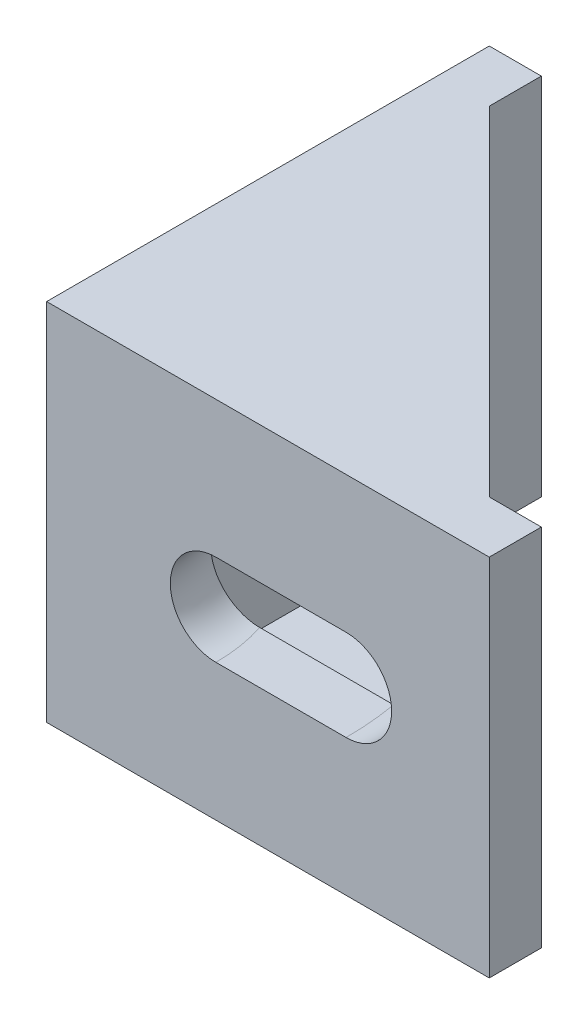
ISO-10303-21;
HEADER;
FILE_DESCRIPTION(('STEP AP214'),'2;1');
FILE_NAME('part.step','',(''),(''),'','','');
FILE_SCHEMA(('AUTOMOTIVE_DESIGN { 1 0 10303 214 1 1 1 1 }'));
ENDSEC;
DATA;
#1=APPLICATION_CONTEXT('core data for automotive mechanical design processes');
#2=APPLICATION_PROTOCOL_DEFINITION('international standard','automotive_design',2000,#1);
#3=PRODUCT_CONTEXT('',#1,'mechanical');
#4=PRODUCT('Part','Part','',(#3));
#5=PRODUCT_RELATED_PRODUCT_CATEGORY('part','',(#4));
#6=PRODUCT_DEFINITION_FORMATION('','',#4);
#7=PRODUCT_DEFINITION_CONTEXT('part definition',#1,'design');
#8=PRODUCT_DEFINITION('design','',#6,#7);
#9=PRODUCT_DEFINITION_SHAPE('','',#8);
#10=(LENGTH_UNIT() NAMED_UNIT(*) SI_UNIT(.MILLI.,.METRE.));
#11=(NAMED_UNIT(*) PLANE_ANGLE_UNIT() SI_UNIT($,.RADIAN.));
#12=(NAMED_UNIT(*) SI_UNIT($,.STERADIAN.) SOLID_ANGLE_UNIT());
#13=UNCERTAINTY_MEASURE_WITH_UNIT(LENGTH_MEASURE(1.E-05),#10,'distance_accuracy_value','');
#14=(GEOMETRIC_REPRESENTATION_CONTEXT(3) GLOBAL_UNCERTAINTY_ASSIGNED_CONTEXT((#13)) GLOBAL_UNIT_ASSIGNED_CONTEXT((#10,
#11,#12)) REPRESENTATION_CONTEXT('',''));
#15=CARTESIAN_POINT('',(0.,0.,0.));
#16=DIRECTION('',(0.,0.,1.));
#17=DIRECTION('',(1.,0.,0.));
#18=AXIS2_PLACEMENT_3D('',#15,#16,#17);
#19=CARTESIAN_POINT('',(34.,28.,-25.8974864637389));
#20=DIRECTION('',(-0.707106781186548,0.,0.707106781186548));
#21=DIRECTION('',(0.707106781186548,0.,0.707106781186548));
#22=AXIS2_PLACEMENT_3D('',#19,#20,#21);
#23=PLANE('',#22);
#24=DIRECTION('',(-0.707106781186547,0.,-0.707106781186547));
#25=VECTOR('',#24,1.);
#26=CARTESIAN_POINT('',(34.,28.,-25.8974864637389));
#27=LINE('',#26,#25);
#28=CARTESIAN_POINT('',(30.,28.,-29.8974864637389));
#29=VERTEX_POINT('',#28);
#30=CARTESIAN_POINT('',(4.00000000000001,28.,-55.8974864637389));
#31=VERTEX_POINT('',#30);
#32=EDGE_CURVE('E56',#29,#31,#27,.T.);
#33=ORIENTED_EDGE('',*,*,#32,.F.);
#34=DIRECTION('',(0.,-1.,0.));
#35=VECTOR('',#34,1.);
#36=CARTESIAN_POINT('',(30.,33.6568542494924,-29.8974864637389));
#37=LINE('',#36,#35);
#38=CARTESIAN_POINT('',(30.,26.,-29.8974864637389));
#39=VERTEX_POINT('',#38);
#40=EDGE_CURVE('E189',#29,#39,#37,.T.);
#41=ORIENTED_EDGE('',*,*,#40,.T.);
#42=DIRECTION('',(-0.707106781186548,0.,-0.707106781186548));
#43=VECTOR('',#42,1.);
#44=CARTESIAN_POINT('',(34.,26.,-25.8974864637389));
#45=LINE('',#44,#43);
#46=CARTESIAN_POINT('',(4.,26.,-55.8974864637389));
#47=VERTEX_POINT('',#46);
#48=EDGE_CURVE('E300',#39,#47,#45,.T.);
#49=ORIENTED_EDGE('',*,*,#48,.T.);
#50=DIRECTION('',(0.,-1.,0.));
#51=VECTOR('',#50,1.);
#52=CARTESIAN_POINT('',(4.00000000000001,33.6568542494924,-55.8974864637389));
#53=LINE('',#52,#51);
#54=EDGE_CURVE('E49',#31,#47,#53,.T.);
#55=ORIENTED_EDGE('',*,*,#54,.F.);
#56=EDGE_LOOP('',(#33,#41,#49,#55));
#57=FACE_BOUND('',#56,.T.);
#58=ADVANCED_FACE('F35',(#57),#23,.F.);
#59=DIRECTION('',(0.707106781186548,0.,0.707106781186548));
#60=VECTOR('',#59,1.);
#61=CARTESIAN_POINT('',(34.,2.,-25.8974864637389));
#62=LINE('',#61,#60);
#63=CARTESIAN_POINT('',(4.,1.99999999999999,-55.8974864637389));
#64=VERTEX_POINT('',#63);
#65=CARTESIAN_POINT('',(30.,2.,-29.8974864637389));
#66=VERTEX_POINT('',#65);
#67=EDGE_CURVE('E296',#64,#66,#62,.T.);
#68=ORIENTED_EDGE('',*,*,#67,.T.);
#69=CARTESIAN_POINT('',(30.,0.,-29.8974864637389));
#70=VERTEX_POINT('',#69);
#71=EDGE_CURVE('E64',#66,#70,#37,.T.);
#72=ORIENTED_EDGE('',*,*,#71,.T.);
#73=DIRECTION('',(-0.707106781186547,0.,-0.707106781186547));
#74=VECTOR('',#73,1.);
#75=CARTESIAN_POINT('',(34.,0.,-25.8974864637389));
#76=LINE('',#75,#74);
#77=CARTESIAN_POINT('',(4.00000000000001,0.,-55.8974864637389));
#78=VERTEX_POINT('',#77);
#79=EDGE_CURVE('E306',#70,#78,#76,.T.);
#80=ORIENTED_EDGE('',*,*,#79,.T.);
#81=EDGE_CURVE('E11',#64,#78,#53,.T.);
#82=ORIENTED_EDGE('',*,*,#81,.F.);
#83=EDGE_LOOP('',(#68,#72,#80,#82));
#84=FACE_BOUND('',#83,.T.);
#85=ADVANCED_FACE('F37',(#84),#23,.F.);
#86=CARTESIAN_POINT('',(0.,28.,-59.8974864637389));
#87=DIRECTION('',(1.,0.,0.));
#88=DIRECTION('',(0.,0.,-1.));
#89=AXIS2_PLACEMENT_3D('',#86,#87,#88);
#90=PLANE('',#89);
#91=DIRECTION('',(0.,0.,1.));
#92=VECTOR('',#91,1.);
#93=CARTESIAN_POINT('',(0.,17.5,-59.8974864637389));
#94=LINE('',#93,#92);
#95=CARTESIAN_POINT('',(0.,17.5,-48.8974864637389));
#96=VERTEX_POINT('',#95);
#97=CARTESIAN_POINT('',(0.,17.5,-38.8974864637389));
#98=VERTEX_POINT('',#97);
#99=EDGE_CURVE('E347',#96,#98,#94,.T.);
#100=ORIENTED_EDGE('',*,*,#99,.T.);
#101=CARTESIAN_POINT('',(0.,14.,-38.8974864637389));
#102=DIRECTION('',(1.,0.,0.));
#103=DIRECTION('',(0.,0.,-1.));
#104=AXIS2_PLACEMENT_3D('',#101,#102,#103);
#105=CIRCLE('',#104,3.5);
#106=CARTESIAN_POINT('',(0.,10.5,-38.8974864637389));
#107=VERTEX_POINT('',#106);
#108=EDGE_CURVE('E345',#98,#107,#105,.T.);
#109=ORIENTED_EDGE('',*,*,#108,.T.);
#110=DIRECTION('',(0.,0.,-1.));
#111=VECTOR('',#110,1.);
#112=CARTESIAN_POINT('',(0.,10.5,-59.8974864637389));
#113=LINE('',#112,#111);
#114=CARTESIAN_POINT('',(0.,10.5,-48.8974864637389));
#115=VERTEX_POINT('',#114);
#116=EDGE_CURVE('E232',#107,#115,#113,.T.);
#117=ORIENTED_EDGE('',*,*,#116,.T.);
#118=CARTESIAN_POINT('',(0.,14.,-48.8974864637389));
#119=DIRECTION('',(1.,0.,0.));
#120=DIRECTION('',(0.,0.,-1.));
#121=AXIS2_PLACEMENT_3D('',#118,#119,#120);
#122=CIRCLE('',#121,3.5);
#123=EDGE_CURVE('E337',#115,#96,#122,.T.);
#124=ORIENTED_EDGE('',*,*,#123,.T.);
#125=EDGE_LOOP('',(#100,#109,#117,#124));
#126=FACE_BOUND('',#125,.T.);
#127=DIRECTION('',(0.,0.,1.));
#128=VECTOR('',#127,1.);
#129=CARTESIAN_POINT('',(0.,0.,-59.8974864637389));
#130=LINE('',#129,#128);
#131=CARTESIAN_POINT('',(0.,0.,-59.8974864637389));
#132=VERTEX_POINT('',#131);
#133=CARTESIAN_POINT('',(0.,0.,-25.8974864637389));
#134=VERTEX_POINT('',#133);
#135=EDGE_CURVE('E308',#132,#134,#130,.T.);
#136=ORIENTED_EDGE('',*,*,#135,.T.);
#137=DIRECTION('',(0.,-1.,0.));
#138=VECTOR('',#137,1.);
#139=CARTESIAN_POINT('',(0.,28.,-25.8974864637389));
#140=LINE('',#139,#138);
#141=CARTESIAN_POINT('',(0.,28.,-25.8974864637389));
#142=VERTEX_POINT('',#141);
#143=EDGE_CURVE('E320',#142,#134,#140,.T.);
#144=ORIENTED_EDGE('',*,*,#143,.F.);
#145=DIRECTION('',(0.,0.,1.));
#146=VECTOR('',#145,1.);
#147=CARTESIAN_POINT('',(0.,28.,-59.8974864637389));
#148=LINE('',#147,#146);
#149=CARTESIAN_POINT('',(0.,28.,-59.8974864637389));
#150=VERTEX_POINT('',#149);
#151=EDGE_CURVE('E372',#150,#142,#148,.T.);
#152=ORIENTED_EDGE('',*,*,#151,.F.);
#153=DIRECTION('',(0.,-1.,0.));
#154=VECTOR('',#153,1.);
#155=CARTESIAN_POINT('',(0.,28.,-59.8974864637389));
#156=LINE('',#155,#154);
#157=EDGE_CURVE('E301',#150,#132,#156,.T.);
#158=ORIENTED_EDGE('',*,*,#157,.T.);
#159=EDGE_LOOP('',(#136,#144,#152,#158));
#160=FACE_BOUND('',#159,.T.);
#161=ADVANCED_FACE('F289',(#126,#160),#90,.F.);
#162=CARTESIAN_POINT('',(0.,28.,-25.8974864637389));
#163=DIRECTION('',(0.,0.,-1.));
#164=DIRECTION('',(-1.,0.,0.));
#165=AXIS2_PLACEMENT_3D('',#162,#163,#164);
#166=PLANE('',#165);
#167=DIRECTION('',(-1.,0.,0.));
#168=VECTOR('',#167,1.);
#169=CARTESIAN_POINT('',(0.,10.5,-25.8974864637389));
#170=LINE('',#169,#168);
#171=CARTESIAN_POINT('',(23.,10.5,-25.8974864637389));
#172=VERTEX_POINT('',#171);
#173=CARTESIAN_POINT('',(13.,10.5,-25.8974864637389));
#174=VERTEX_POINT('',#173);
#175=EDGE_CURVE('E229',#172,#174,#170,.T.);
#176=ORIENTED_EDGE('',*,*,#175,.T.);
#177=CARTESIAN_POINT('',(13.,14.,-25.8974864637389));
#178=DIRECTION('',(0.,0.,-1.));
#179=DIRECTION('',(-1.,0.,0.));
#180=AXIS2_PLACEMENT_3D('',#177,#178,#179);
#181=CIRCLE('',#180,3.5);
#182=CARTESIAN_POINT('',(13.,17.5,-25.8974864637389));
#183=VERTEX_POINT('',#182);
#184=EDGE_CURVE('E353',#174,#183,#181,.T.);
#185=ORIENTED_EDGE('',*,*,#184,.T.);
#186=DIRECTION('',(1.,0.,0.));
#187=VECTOR('',#186,1.);
#188=CARTESIAN_POINT('',(0.,17.5,-25.8974864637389));
#189=LINE('',#188,#187);
#190=CARTESIAN_POINT('',(23.,17.5,-25.8974864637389));
#191=VERTEX_POINT('',#190);
#192=EDGE_CURVE('E350',#183,#191,#189,.T.);
#193=ORIENTED_EDGE('',*,*,#192,.T.);
#194=CARTESIAN_POINT('',(23.,14.,-25.8974864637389));
#195=DIRECTION('',(0.,0.,-1.));
#196=DIRECTION('',(-1.,0.,0.));
#197=AXIS2_PLACEMENT_3D('',#194,#195,#196);
#198=CIRCLE('',#197,3.5);
#199=EDGE_CURVE('E242',#191,#172,#198,.T.);
#200=ORIENTED_EDGE('',*,*,#199,.T.);
#201=EDGE_LOOP('',(#176,#185,#193,#200));
#202=FACE_BOUND('',#201,.T.);
#203=DIRECTION('',(1.,0.,0.));
#204=VECTOR('',#203,1.);
#205=CARTESIAN_POINT('',(0.,0.,-25.8974864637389));
#206=LINE('',#205,#204);
#207=CARTESIAN_POINT('',(34.,0.,-25.8974864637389));
#208=VERTEX_POINT('',#207);
#209=EDGE_CURVE('E311',#134,#208,#206,.T.);
#210=ORIENTED_EDGE('',*,*,#209,.T.);
#211=DIRECTION('',(0.,-1.,0.));
#212=VECTOR('',#211,1.);
#213=CARTESIAN_POINT('',(34.,28.,-25.8974864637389));
#214=LINE('',#213,#212);
#215=CARTESIAN_POINT('',(34.,28.,-25.8974864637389));
#216=VERTEX_POINT('',#215);
#217=EDGE_CURVE('E318',#216,#208,#214,.T.);
#218=ORIENTED_EDGE('',*,*,#217,.F.);
#219=DIRECTION('',(1.,0.,0.));
#220=VECTOR('',#219,1.);
#221=CARTESIAN_POINT('',(0.,28.,-25.8974864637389));
#222=LINE('',#221,#220);
#223=EDGE_CURVE('E174',#142,#216,#222,.T.);
#224=ORIENTED_EDGE('',*,*,#223,.F.);
#225=ORIENTED_EDGE('',*,*,#143,.T.);
#226=EDGE_LOOP('',(#210,#218,#224,#225));
#227=FACE_BOUND('',#226,.T.);
#228=ADVANCED_FACE('F293',(#202,#227),#166,.F.);
#229=CARTESIAN_POINT('',(0.,28.,0.));
#230=DIRECTION('',(0.,1.,0.));
#231=DIRECTION('',(0.,0.,1.));
#232=AXIS2_PLACEMENT_3D('',#229,#230,#231);
#233=PLANE('',#232);
#234=ORIENTED_EDGE('',*,*,#223,.T.);
#235=DIRECTION('',(0.,0.,1.));
#236=VECTOR('',#235,1.);
#237=CARTESIAN_POINT('',(34.,28.,-25.8974864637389));
#238=LINE('',#237,#236);
#239=CARTESIAN_POINT('',(34.,28.,-29.8974864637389));
#240=VERTEX_POINT('',#239);
#241=EDGE_CURVE('E167',#240,#216,#238,.T.);
#242=ORIENTED_EDGE('',*,*,#241,.F.);
#243=DIRECTION('',(1.,0.,0.));
#244=VECTOR('',#243,1.);
#245=CARTESIAN_POINT('',(34.,28.,-29.8974864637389));
#246=LINE('',#245,#244);
#247=EDGE_CURVE('E171',#29,#240,#246,.T.);
#248=ORIENTED_EDGE('',*,*,#247,.F.);
#249=ORIENTED_EDGE('',*,*,#32,.T.);
#250=DIRECTION('',(0.,0.,1.));
#251=VECTOR('',#250,1.);
#252=CARTESIAN_POINT('',(4.,28.,-59.8974864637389));
#253=LINE('',#252,#251);
#254=CARTESIAN_POINT('',(4.,28.,-59.8974864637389));
#255=VERTEX_POINT('',#254);
#256=EDGE_CURVE('E206',#255,#31,#253,.T.);
#257=ORIENTED_EDGE('',*,*,#256,.F.);
#258=DIRECTION('',(1.,0.,0.));
#259=VECTOR('',#258,1.);
#260=CARTESIAN_POINT('',(0.,28.,-59.8974864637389));
#261=LINE('',#260,#259);
#262=EDGE_CURVE('E200',#150,#255,#261,.T.);
#263=ORIENTED_EDGE('',*,*,#262,.F.);
#264=ORIENTED_EDGE('',*,*,#151,.T.);
#265=EDGE_LOOP('',(#234,#242,#248,#249,#257,#263,#264));
#266=FACE_BOUND('',#265,.T.);
#267=ADVANCED_FACE('F169',(#266),#233,.T.);
#268=CARTESIAN_POINT('',(0.,0.,0.));
#269=DIRECTION('',(0.,1.,0.));
#270=DIRECTION('',(0.,0.,1.));
#271=AXIS2_PLACEMENT_3D('',#268,#269,#270);
#272=PLANE('',#271);
#273=ORIENTED_EDGE('',*,*,#79,.F.);
#274=DIRECTION('',(1.,0.,0.));
#275=VECTOR('',#274,1.);
#276=CARTESIAN_POINT('',(34.,0.,-29.8974864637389));
#277=LINE('',#276,#275);
#278=CARTESIAN_POINT('',(34.,0.,-29.8974864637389));
#279=VERTEX_POINT('',#278);
#280=EDGE_CURVE('E191',#70,#279,#277,.T.);
#281=ORIENTED_EDGE('',*,*,#280,.T.);
#282=DIRECTION('',(0.,0.,1.));
#283=VECTOR('',#282,1.);
#284=CARTESIAN_POINT('',(34.,0.,-25.8974864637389));
#285=LINE('',#284,#283);
#286=EDGE_CURVE('E183',#279,#208,#285,.T.);
#287=ORIENTED_EDGE('',*,*,#286,.T.);
#288=ORIENTED_EDGE('',*,*,#209,.F.);
#289=ORIENTED_EDGE('',*,*,#135,.F.);
#290=DIRECTION('',(1.,0.,0.));
#291=VECTOR('',#290,1.);
#292=CARTESIAN_POINT('',(0.,0.,-59.8974864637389));
#293=LINE('',#292,#291);
#294=CARTESIAN_POINT('',(4.,0.,-59.8974864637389));
#295=VERTEX_POINT('',#294);
#296=EDGE_CURVE('E196',#132,#295,#293,.T.);
#297=ORIENTED_EDGE('',*,*,#296,.T.);
#298=DIRECTION('',(0.,0.,1.));
#299=VECTOR('',#298,1.);
#300=CARTESIAN_POINT('',(4.,0.,-59.8974864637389));
#301=LINE('',#300,#299);
#302=EDGE_CURVE('E197',#295,#78,#301,.T.);
#303=ORIENTED_EDGE('',*,*,#302,.T.);
#304=EDGE_LOOP('',(#273,#281,#287,#288,#289,#297,#303));
#305=FACE_BOUND('',#304,.T.);
#306=ADVANCED_FACE('F276',(#305),#272,.F.);
#307=CARTESIAN_POINT('',(32.,26.,-59.8974864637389));
#308=DIRECTION('',(0.,1.,0.));
#309=DIRECTION('',(0.,0.,1.));
#310=AXIS2_PLACEMENT_3D('',#307,#308,#309);
#311=PLANE('',#310);
#312=DIRECTION('',(-1.,0.,0.));
#313=VECTOR('',#312,1.);
#314=CARTESIAN_POINT('',(32.,26.,-29.8974864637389));
#315=LINE('',#314,#313);
#316=CARTESIAN_POINT('',(4.,26.,-29.8974864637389));
#317=VERTEX_POINT('',#316);
#318=EDGE_CURVE('E309',#39,#317,#315,.T.);
#319=ORIENTED_EDGE('',*,*,#318,.T.);
#320=DIRECTION('',(0.,0.,-1.));
#321=VECTOR('',#320,1.);
#322=CARTESIAN_POINT('',(4.,26.,-59.8974864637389));
#323=LINE('',#322,#321);
#324=EDGE_CURVE('E369',#317,#47,#323,.T.);
#325=ORIENTED_EDGE('',*,*,#324,.T.);
#326=ORIENTED_EDGE('',*,*,#48,.F.);
#327=EDGE_LOOP('',(#319,#325,#326));
#328=FACE_BOUND('',#327,.T.);
#329=ADVANCED_FACE('F273',(#328),#311,.F.);
#330=CARTESIAN_POINT('',(32.,26.,-29.8974864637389));
#331=DIRECTION('',(0.,0.,1.));
#332=DIRECTION('',(0.,-1.,0.));
#333=AXIS2_PLACEMENT_3D('',#330,#331,#332);
#334=PLANE('',#333);
#335=DIRECTION('',(-1.,0.,0.));
#336=VECTOR('',#335,1.);
#337=CARTESIAN_POINT('',(32.,17.5,-29.8974864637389));
#338=LINE('',#337,#336);
#339=CARTESIAN_POINT('',(22.6495033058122,17.5,-29.8974864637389));
#340=VERTEX_POINT('',#339);
#341=CARTESIAN_POINT('',(12.369316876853,17.5,-29.8974864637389));
#342=VERTEX_POINT('',#341);
#343=EDGE_CURVE('E356',#340,#342,#338,.T.);
#344=ORIENTED_EDGE('',*,*,#343,.T.);
#345=CARTESIAN_POINT('',(8.82464637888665,12.86576886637,-29.8974864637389));
#346=CARTESIAN_POINT('',(8.85966284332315,12.772667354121,-29.8974864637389));
#347=CARTESIAN_POINT('',(8.89887566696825,12.6811357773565,-29.8974864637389));
#348=CARTESIAN_POINT('',(8.9852018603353,12.5018628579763,-29.8974864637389));
#349=CARTESIAN_POINT('',(9.03231898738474,12.4141233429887,-29.8974864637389));
#350=CARTESIAN_POINT('',(9.18493240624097,12.157194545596,-29.8974864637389));
#351=CARTESIAN_POINT('',(9.30161569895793,11.9944916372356,-29.8974864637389));
#352=CARTESIAN_POINT('',(9.55946729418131,11.6912186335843,-29.8974864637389));
#353=CARTESIAN_POINT('',(9.70053496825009,11.5505619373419,-29.8974864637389));
#354=CARTESIAN_POINT('',(10.0029783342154,11.2932712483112,-29.8974864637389));
#355=CARTESIAN_POINT('',(10.1643474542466,11.1766295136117,-29.8974864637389));
#356=CARTESIAN_POINT('',(10.5134805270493,10.9631461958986,-29.8974864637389));
#357=CARTESIAN_POINT('',(10.7022566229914,10.867959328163,-29.8974864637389));
#358=CARTESIAN_POINT('',(11.0926816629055,10.7091330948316,-29.8974864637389));
#359=CARTESIAN_POINT('',(11.2943347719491,10.6455039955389,-29.8974864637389));
#360=CARTESIAN_POINT('',(11.7138624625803,10.5494771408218,-29.8974864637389));
#361=CARTESIAN_POINT('',(11.9320627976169,10.5184941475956,-29.8974864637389));
#362=CARTESIAN_POINT('',(12.3705875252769,10.4937876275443,-29.8974864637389));
#363=CARTESIAN_POINT('',(12.5909119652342,10.5000649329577,-29.8974864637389));
#364=CARTESIAN_POINT('',(13.0260837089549,10.5501690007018,-29.8974864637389));
#365=CARTESIAN_POINT('',(13.2409541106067,10.5937934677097,-29.8974864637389));
#366=CARTESIAN_POINT('',(13.6598446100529,10.7177738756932,-29.8974864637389));
#367=CARTESIAN_POINT('',(13.8638665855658,10.7981234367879,-29.8974864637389));
#368=CARTESIAN_POINT('',(14.2477744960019,10.990487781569,-29.8974864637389));
#369=CARTESIAN_POINT('',(14.4282442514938,11.1013365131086,-29.8974864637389));
#370=CARTESIAN_POINT('',(14.766965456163,11.3529648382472,-29.8974864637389));
#371=CARTESIAN_POINT('',(14.9252220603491,11.4937374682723,-29.8974864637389));
#372=CARTESIAN_POINT('',(15.2082062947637,11.7950288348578,-29.8974864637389));
#373=CARTESIAN_POINT('',(15.3340334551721,11.9545151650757,-29.8974864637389));
#374=CARTESIAN_POINT('',(15.5560303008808,12.2929468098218,-29.8974864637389));
#375=CARTESIAN_POINT('',(15.6522060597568,12.4718881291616,-29.8974864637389));
#376=CARTESIAN_POINT('',(15.8089361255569,12.8377186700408,-29.8974864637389));
#377=CARTESIAN_POINT('',(15.8705657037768,13.0241477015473,-29.8974864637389));
#378=CARTESIAN_POINT('',(15.9609570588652,13.4048076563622,-29.8974864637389));
#379=CARTESIAN_POINT('',(15.989723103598,13.5990375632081,-29.8974864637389));
#380=CARTESIAN_POINT('',(16.0131951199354,13.9857556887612,-29.8974864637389));
#381=CARTESIAN_POINT('',(16.0085496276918,14.178204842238,-29.8974864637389));
#382=CARTESIAN_POINT('',(15.9668847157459,14.5595573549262,-29.8974864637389));
#383=CARTESIAN_POINT('',(15.9298667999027,14.7484608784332,-29.8974864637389));
#384=CARTESIAN_POINT('',(15.8248449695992,15.1167134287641,-29.8974864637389));
#385=CARTESIAN_POINT('',(15.7569505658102,15.2960937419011,-29.8974864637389));
#386=CARTESIAN_POINT('',(15.5923588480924,15.6410986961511,-29.8974864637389));
#387=CARTESIAN_POINT('',(15.4956605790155,15.8067228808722,-29.8974864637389));
#388=CARTESIAN_POINT('',(15.2750927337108,16.1217709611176,-29.8974864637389));
#389=CARTESIAN_POINT('',(15.1509068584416,16.2709732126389,-29.8974864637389));
#390=CARTESIAN_POINT('',(14.8798275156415,16.5470594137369,-29.8974864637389));
#391=CARTESIAN_POINT('',(14.732931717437,16.6739410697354,-29.8974864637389));
#392=CARTESIAN_POINT('',(14.4165787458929,16.9054279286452,-29.8974864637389));
#393=CARTESIAN_POINT('',(14.2466317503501,17.0093632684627,-29.8974864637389));
#394=CARTESIAN_POINT('',(13.8921786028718,17.1883713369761,-29.8974864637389));
#395=CARTESIAN_POINT('',(13.707670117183,17.2634394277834,-29.8974864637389));
#396=CARTESIAN_POINT('',(13.3221884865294,17.3855326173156,-29.8974864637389));
#397=CARTESIAN_POINT('',(13.120860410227,17.431436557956,-29.8974864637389));
#398=CARTESIAN_POINT('',(12.7134448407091,17.4901799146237,-29.8974864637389));
#399=CARTESIAN_POINT('',(12.5073564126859,17.5030127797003,-29.8974864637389));
#400=CARTESIAN_POINT('',(12.0877075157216,17.4956590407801,-29.8974864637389));
#401=CARTESIAN_POINT('',(11.8741696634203,17.4741629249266,-29.8974864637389));
#402=CARTESIAN_POINT('',(11.4534455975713,17.3966280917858,-29.8974864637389));
#403=CARTESIAN_POINT('',(11.2462606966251,17.3405822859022,-29.8974864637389));
#404=CARTESIAN_POINT('',(10.8383200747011,17.1935156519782,-29.8974864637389));
#405=CARTESIAN_POINT('',(10.6378887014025,17.1015918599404,-29.8974864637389));
#406=CARTESIAN_POINT('',(10.2554194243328,16.8851850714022,-29.8974864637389));
#407=CARTESIAN_POINT('',(10.0733838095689,16.7606980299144,-29.8974864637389));
#408=CARTESIAN_POINT('',(9.73495613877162,16.4830240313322,-29.8974864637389));
#409=CARTESIAN_POINT('',(9.5783628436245,16.330085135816,-29.8974864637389));
#410=CARTESIAN_POINT('',(9.36602514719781,16.0816953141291,-29.8974864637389));
#411=CARTESIAN_POINT('',(9.29897962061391,15.995692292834,-29.8974864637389));
#412=CARTESIAN_POINT('',(9.17310612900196,15.8178895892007,-29.8974864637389));
#413=CARTESIAN_POINT('',(9.11427386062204,15.7260929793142,-29.8974864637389));
#414=CARTESIAN_POINT('',(9.00887783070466,15.5431356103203,-29.8974864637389));
#415=CARTESIAN_POINT('',(8.96178353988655,15.4522798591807,-29.8974864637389));
#416=CARTESIAN_POINT('',(8.87605495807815,15.2667043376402,-29.8974864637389));
#417=CARTESIAN_POINT('',(8.83741650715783,15.1719864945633,-29.8974864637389));
#418=CARTESIAN_POINT('',(8.76908994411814,14.979379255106,-29.8974864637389));
#419=CARTESIAN_POINT('',(8.73940117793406,14.8814900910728,-29.8974864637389));
#420=CARTESIAN_POINT('',(8.68939929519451,14.6833483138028,-29.8974864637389));
#421=CARTESIAN_POINT('',(8.66908519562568,14.5830959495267,-29.8974864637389));
#422=CARTESIAN_POINT('',(8.63948168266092,14.3898772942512,-29.8974864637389));
#423=CARTESIAN_POINT('',(8.62938876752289,14.2970333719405,-29.8974864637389));
#424=CARTESIAN_POINT('',(8.61740897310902,14.1108204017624,-29.8974864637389));
#425=CARTESIAN_POINT('',(8.61552152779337,14.0174513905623,-29.8974864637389));
#426=CARTESIAN_POINT('',(8.61997409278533,13.8310481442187,-29.8974864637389));
#427=CARTESIAN_POINT('',(8.62630205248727,13.7380136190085,-29.8974864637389));
#428=CARTESIAN_POINT('',(8.64707651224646,13.5528899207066,-29.8974864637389));
#429=CARTESIAN_POINT('',(8.66152006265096,13.4608004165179,-29.8974864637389));
#430=CARTESIAN_POINT('',(8.69721455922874,13.2837824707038,-29.8974864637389));
#431=CARTESIAN_POINT('',(8.71799779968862,13.1987592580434,-29.8974864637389));
#432=CARTESIAN_POINT('',(8.76632249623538,13.0306760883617,-29.8974864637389));
#433=CARTESIAN_POINT('',(8.79386287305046,12.947615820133,-29.8974864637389));
#434=CARTESIAN_POINT('',(8.82464637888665,12.86576886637,-29.8974864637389));
#435=B_SPLINE_CURVE_WITH_KNOTS('',3,(#345,#346,#347,#348,#349,#350,#351,#352,#353,#354,#355,
#356,#357,#358,#359,#360,#361,#362,#363,#364,#365,#366,#367,#368,#369,#370,#371,#372,#373,#374,
#375,#376,#377,#378,#379,#380,#381,#382,#383,#384,#385,#386,#387,#388,#389,#390,#391,#392,#393,
#394,#395,#396,#397,#398,#399,#400,#401,#402,#403,#404,#405,#406,#407,#408,#409,#410,#411,#412,
#413,#414,#415,#416,#417,#418,#419,#420,#421,#422,#423,#424,#425,#426,#427,#428,#429,#430,#431,
#432,#433,#434),.UNSPECIFIED.,.T.,.F.,(4,2,2,2,2,2,2,2,2,2,2,2,2,2,2,2,2,2,2,2,2,2,2,2,2,2,2,2,
2,2,2,2,2,2,2,2,2,2,2,2,2,2,2,2,4),(0.,0.298312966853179,0.596768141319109,1.19430138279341,
1.78942518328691,2.3843568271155,3.01580421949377,3.64745689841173,4.30548011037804,
4.96351801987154,5.61801397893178,6.27239628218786,6.90459039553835,7.53663755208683,
8.14305055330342,8.74933925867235,9.33552721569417,9.92163903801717,10.4964052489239,
11.0711447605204,11.6438615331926,12.2165972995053,12.7963020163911,13.3760662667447,
13.9710027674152,14.5660348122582,15.182742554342,15.7995724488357,16.4404992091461,
17.0815575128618,17.7399142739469,18.3983528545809,19.0512990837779,19.3780654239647,
19.7046599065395,20.0112636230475,20.3177161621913,20.6241462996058,20.9305442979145,
21.2103628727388,21.4901621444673,21.76955146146,22.0488392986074,22.3111326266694,
22.5733840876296),.UNSPECIFIED.);
#436=CARTESIAN_POINT('',(12.369316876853,10.5,-29.8974864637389));
#437=VERTEX_POINT('',#436);
#438=EDGE_CURVE('E349',#342,#437,#435,.T.);
#439=ORIENTED_EDGE('',*,*,#438,.T.);
#440=DIRECTION('',(1.,0.,0.));
#441=VECTOR('',#440,1.);
#442=CARTESIAN_POINT('',(32.,10.5,-29.8974864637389));
#443=LINE('',#442,#441);
#444=CARTESIAN_POINT('',(22.6495033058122,10.5,-29.8974864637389));
#445=VERTEX_POINT('',#444);
#446=EDGE_CURVE('E226',#437,#445,#443,.T.);
#447=ORIENTED_EDGE('',*,*,#446,.T.);
#448=CARTESIAN_POINT('',(19.5404139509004,12.2909751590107,-29.8974864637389));
#449=CARTESIAN_POINT('',(19.638976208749,12.1184219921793,-29.8974864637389));
#450=CARTESIAN_POINT('',(19.7524110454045,11.9541777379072,-29.8974864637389));
#451=CARTESIAN_POINT('',(20.0054640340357,11.6470302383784,-29.8974864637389));
#452=CARTESIAN_POINT('',(20.1451196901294,11.5041580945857,-29.8974864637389));
#453=CARTESIAN_POINT('',(20.4461554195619,11.243923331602,-29.8974864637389));
#454=CARTESIAN_POINT('',(20.6075076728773,11.1265285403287,-29.8974864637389));
#455=CARTESIAN_POINT('',(20.9473654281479,10.9201207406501,-29.8974864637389));
#456=CARTESIAN_POINT('',(21.1258665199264,10.8311004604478,-29.8974864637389));
#457=CARTESIAN_POINT('',(21.4974921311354,10.6827145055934,-29.8974864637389));
#458=CARTESIAN_POINT('',(21.6907763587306,10.6237486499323,-29.8974864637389));
#459=CARTESIAN_POINT('',(22.0844757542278,10.5387982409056,-29.8974864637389));
#460=CARTESIAN_POINT('',(22.2848916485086,10.5128170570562,-29.8974864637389));
#461=CARTESIAN_POINT('',(22.6889192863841,10.4945102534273,-29.8974864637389));
#462=CARTESIAN_POINT('',(22.892543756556,10.5024635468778,-29.8974864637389));
#463=CARTESIAN_POINT('',(23.2955531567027,10.5525396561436,-29.8974864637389));
#464=CARTESIAN_POINT('',(23.4949381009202,10.5946623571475,-29.8974864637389));
#465=CARTESIAN_POINT('',(23.8831571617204,10.7118663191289,-29.8974864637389));
#466=CARTESIAN_POINT('',(24.0720199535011,10.7868525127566,-29.8974864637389));
#467=CARTESIAN_POINT('',(24.4342810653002,10.9677977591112,-29.8974864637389));
#468=CARTESIAN_POINT('',(24.6076801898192,11.0737551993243,-29.8974864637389));
#469=CARTESIAN_POINT('',(24.9321086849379,11.3124744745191,-29.8974864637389));
#470=CARTESIAN_POINT('',(25.0833546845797,11.4449418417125,-29.8974864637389));
#471=CARTESIAN_POINT('',(25.3610999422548,11.7336860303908,-29.8974864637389));
#472=CARTESIAN_POINT('',(25.4876009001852,11.8899612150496,-29.8974864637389));
#473=CARTESIAN_POINT('',(25.7105465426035,12.2197199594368,-29.8974864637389));
#474=CARTESIAN_POINT('',(25.8073569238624,12.3929563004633,-29.8974864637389));
#475=CARTESIAN_POINT('',(25.9701629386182,12.7533498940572,-29.8974864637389));
#476=CARTESIAN_POINT('',(26.03616052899,12.9405062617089,-29.8974864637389));
#477=CARTESIAN_POINT('',(26.1347968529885,13.3213117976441,-29.8974864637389));
#478=CARTESIAN_POINT('',(26.1677782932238,13.5148722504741,-29.8974864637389));
#479=CARTESIAN_POINT('',(26.2005910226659,13.9047805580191,-29.8974864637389));
#480=CARTESIAN_POINT('',(26.2004235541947,14.1011283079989,-29.8974864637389));
#481=CARTESIAN_POINT('',(26.1670325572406,14.4899704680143,-29.8974864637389));
#482=CARTESIAN_POINT('',(26.1339787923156,14.6824794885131,-29.8974864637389));
#483=CARTESIAN_POINT('',(26.0360635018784,15.0592260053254,-29.8974864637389));
#484=CARTESIAN_POINT('',(25.971202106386,15.243463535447,-29.8974864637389));
#485=CARTESIAN_POINT('',(25.8114894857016,15.5987544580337,-29.8974864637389));
#486=CARTESIAN_POINT('',(25.7165956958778,15.7697887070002,-29.8974864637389));
#487=CARTESIAN_POINT('',(25.4996451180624,16.0936544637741,-29.8974864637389));
#488=CARTESIAN_POINT('',(25.377587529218,16.2464854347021,-29.8974864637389));
#489=CARTESIAN_POINT('',(25.1088286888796,16.5308848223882,-29.8974864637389));
#490=CARTESIAN_POINT('',(24.961947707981,16.6622833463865,-29.8974864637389));
#491=CARTESIAN_POINT('',(24.6484317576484,16.8988978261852,-29.8974864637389));
#492=CARTESIAN_POINT('',(24.4817956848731,17.0041123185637,-29.8974864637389));
#493=CARTESIAN_POINT('',(24.1314102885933,17.1867103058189,-29.8974864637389));
#494=CARTESIAN_POINT('',(23.9474823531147,17.2637510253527,-29.8974864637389));
#495=CARTESIAN_POINT('',(23.5694050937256,17.3862893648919,-29.8974864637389));
#496=CARTESIAN_POINT('',(23.3752550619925,17.4317847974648,-29.8974864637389));
#497=CARTESIAN_POINT('',(22.9796505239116,17.490502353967,-29.8974864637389));
#498=CARTESIAN_POINT('',(22.778135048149,17.5033139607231,-29.8974864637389));
#499=CARTESIAN_POINT('',(22.3757783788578,17.4952277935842,-29.8974864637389));
#500=CARTESIAN_POINT('',(22.1749372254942,17.4743280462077,-29.8974864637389));
#501=CARTESIAN_POINT('',(21.7778691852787,17.3991126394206,-29.8974864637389));
#502=CARTESIAN_POINT('',(21.5816947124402,17.3445199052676,-29.8974864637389));
#503=CARTESIAN_POINT('',(21.2012950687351,17.2031529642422,-29.8974864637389));
#504=CARTESIAN_POINT('',(21.0170701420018,17.1163781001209,-29.8974864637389));
#505=CARTESIAN_POINT('',(20.666060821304,16.913053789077,-29.8974864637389));
#506=CARTESIAN_POINT('',(20.4992611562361,16.796530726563,-29.8974864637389));
#507=CARTESIAN_POINT('',(20.1878960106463,16.5368124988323,-29.8974864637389));
#508=CARTESIAN_POINT('',(20.0433293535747,16.3936187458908,-29.8974864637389));
#509=CARTESIAN_POINT('',(19.7825368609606,16.08643307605,-29.8974864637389));
#510=CARTESIAN_POINT('',(19.6659839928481,15.9227189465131,-29.8974864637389));
#511=CARTESIAN_POINT('',(19.4626613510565,15.5777417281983,-29.8974864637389));
#512=CARTESIAN_POINT('',(19.3758868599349,15.3964814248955,-29.8974864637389));
#513=CARTESIAN_POINT('',(19.236360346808,15.025340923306,-29.8974864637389));
#514=CARTESIAN_POINT('',(19.1829784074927,14.8356974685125,-29.8974864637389));
#515=CARTESIAN_POINT('',(19.1093617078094,14.4500306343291,-29.8974864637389));
#516=CARTESIAN_POINT('',(19.0891320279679,14.2540062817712,-29.8974864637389));
#517=CARTESIAN_POINT('',(19.0825593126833,13.8643587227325,-29.8974864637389));
#518=CARTESIAN_POINT('',(19.0957134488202,13.6707435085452,-29.8974864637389));
#519=CARTESIAN_POINT('',(19.154419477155,13.2886646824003,-29.8974864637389));
#520=CARTESIAN_POINT('',(19.1999302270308,13.1001948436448,-29.8974864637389));
#521=CARTESIAN_POINT('',(19.296909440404,12.8083419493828,-29.8974864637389));
#522=CARTESIAN_POINT('',(19.3384181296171,12.7015423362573,-29.8974864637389));
#523=CARTESIAN_POINT('',(19.4317769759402,12.4925675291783,-29.8974864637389));
#524=CARTESIAN_POINT('',(19.4836269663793,12.3903922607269,-29.8974864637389));
#525=CARTESIAN_POINT('',(19.5404139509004,12.2909751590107,-29.8974864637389));
#526=B_SPLINE_CURVE_WITH_KNOTS('',3,(#448,#449,#450,#451,#452,#453,#454,#455,#456,#457,#458,
#459,#460,#461,#462,#463,#464,#465,#466,#467,#468,#469,#470,#471,#472,#473,#474,#475,#476,#477,
#478,#479,#480,#481,#482,#483,#484,#485,#486,#487,#488,#489,#490,#491,#492,#493,#494,#495,#496,
#497,#498,#499,#500,#501,#502,#503,#504,#505,#506,#507,#508,#509,#510,#511,#512,#513,#514,#515,
#516,#517,#518,#519,#520,#521,#522,#523,#524,#525),.UNSPECIFIED.,.T.,.F.,(4,2,2,2,2,2,2,2,2,2,2,
2,2,2,2,2,2,2,2,2,2,2,2,2,2,2,2,2,2,2,2,2,2,2,2,2,2,2,4),(0.,0.595728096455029,1.19231485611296,
1.78814382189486,2.38381996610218,2.98722619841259,3.59069406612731,4.19913145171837,
4.80756679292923,5.41425355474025,6.02090873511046,6.62116604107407,7.22138209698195,
7.81387727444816,8.40633481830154,8.99257684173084,9.57879689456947,10.1620064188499,
10.7452135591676,11.3292510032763,11.9133056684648,12.5017860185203,13.0902992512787,
13.6857514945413,14.2812450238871,14.8841820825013,15.4871544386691,16.0951526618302,
16.7031633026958,17.3106365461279,17.9180776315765,18.518039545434,19.1179063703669,
19.7060860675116,20.2943558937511,20.8738179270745,21.4525444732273,21.7957808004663,
22.1390115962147),.UNSPECIFIED.);
#527=EDGE_CURVE('E235',#445,#340,#526,.T.);
#528=ORIENTED_EDGE('',*,*,#527,.T.);
#529=EDGE_LOOP('',(#344,#439,#447,#528));
#530=FACE_BOUND('',#529,.T.);
#531=DIRECTION('',(-1.,0.,0.));
#532=VECTOR('',#531,1.);
#533=CARTESIAN_POINT('',(32.,2.,-29.8974864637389));
#534=LINE('',#533,#532);
#535=CARTESIAN_POINT('',(4.,2.,-29.8974864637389));
#536=VERTEX_POINT('',#535);
#537=EDGE_CURVE('E304',#66,#536,#534,.T.);
#538=ORIENTED_EDGE('',*,*,#537,.T.);
#539=DIRECTION('',(0.,1.,0.));
#540=VECTOR('',#539,1.);
#541=CARTESIAN_POINT('',(4.,26.,-29.8974864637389));
#542=LINE('',#541,#540);
#543=EDGE_CURVE('E367',#536,#317,#542,.T.);
#544=ORIENTED_EDGE('',*,*,#543,.T.);
#545=ORIENTED_EDGE('',*,*,#318,.F.);
#546=ORIENTED_EDGE('',*,*,#40,.F.);
#547=ORIENTED_EDGE('',*,*,#247,.T.);
#548=DIRECTION('',(0.,-1.,0.));
#549=VECTOR('',#548,1.);
#550=CARTESIAN_POINT('',(34.,33.6568542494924,-29.8974864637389));
#551=LINE('',#550,#549);
#552=EDGE_CURVE('E178',#240,#279,#551,.T.);
#553=ORIENTED_EDGE('',*,*,#552,.T.);
#554=ORIENTED_EDGE('',*,*,#280,.F.);
#555=ORIENTED_EDGE('',*,*,#71,.F.);
#556=EDGE_LOOP('',(#538,#544,#545,#546,#547,#553,#554,#555));
#557=FACE_BOUND('',#556,.T.);
#558=ADVANCED_FACE('F188',(#530,#557),#334,.F.);
#559=CARTESIAN_POINT('',(32.,2.,-29.8974864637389));
#560=DIRECTION('',(0.,-1.,0.));
#561=DIRECTION('',(0.,0.,-1.));
#562=AXIS2_PLACEMENT_3D('',#559,#560,#561);
#563=PLANE('',#562);
#564=DIRECTION('',(0.,0.,1.));
#565=VECTOR('',#564,1.);
#566=CARTESIAN_POINT('',(4.,2.,-29.8974864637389));
#567=LINE('',#566,#565);
#568=EDGE_CURVE('E365',#64,#536,#567,.T.);
#569=ORIENTED_EDGE('',*,*,#568,.T.);
#570=ORIENTED_EDGE('',*,*,#537,.F.);
#571=ORIENTED_EDGE('',*,*,#67,.F.);
#572=EDGE_LOOP('',(#569,#570,#571));
#573=FACE_BOUND('',#572,.T.);
#574=ADVANCED_FACE('F269',(#573),#563,.F.);
#575=CARTESIAN_POINT('',(4.,0.,0.));
#576=DIRECTION('',(1.,0.,0.));
#577=DIRECTION('',(0.,0.,-1.));
#578=AXIS2_PLACEMENT_3D('',#575,#576,#577);
#579=PLANE('',#578);
#580=CARTESIAN_POINT('',(4.,10.6098878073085,-37.3488428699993));
#581=CARTESIAN_POINT('',(4.,10.5588370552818,-37.5595592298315));
#582=CARTESIAN_POINT('',(4.,10.5252577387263,-37.7746777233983));
#583=CARTESIAN_POINT('',(4.,10.4943757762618,-38.207710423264));
#584=CARTESIAN_POINT('',(4.,10.4971176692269,-38.425627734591));
#585=CARTESIAN_POINT('',(4.,10.5394642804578,-38.8580815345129));
#586=CARTESIAN_POINT('',(4.,10.5790977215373,-39.0726152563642));
#587=CARTESIAN_POINT('',(4.,10.694829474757,-39.4915740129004));
#588=CARTESIAN_POINT('',(4.,10.7709138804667,-39.6960028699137));
#589=CARTESIAN_POINT('',(4.,10.9554458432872,-40.0829868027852));
#590=CARTESIAN_POINT('',(4.,11.062969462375,-40.2659818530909));
#591=CARTESIAN_POINT('',(4.,11.3084456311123,-40.610307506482));
#592=CARTESIAN_POINT('',(4.,11.4463927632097,-40.7716419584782));
#593=CARTESIAN_POINT('',(4.,11.7427412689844,-41.0610993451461));
#594=CARTESIAN_POINT('',(4.,11.9000869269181,-41.1903033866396));
#595=CARTESIAN_POINT('',(4.,12.2348687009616,-41.4193532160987));
#596=CARTESIAN_POINT('',(4.,12.41230053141,-41.5192052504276));
#597=CARTESIAN_POINT('',(4.,12.7757180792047,-41.6832810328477));
#598=CARTESIAN_POINT('',(4.,12.9612123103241,-41.7485944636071));
#599=CARTESIAN_POINT('',(4.,13.3406531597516,-41.8464288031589));
#600=CARTESIAN_POINT('',(4.,13.5345986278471,-41.8789541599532));
#601=CARTESIAN_POINT('',(4.,13.9212317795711,-41.9098058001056));
#602=CARTESIAN_POINT('',(4.,14.1138656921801,-41.9088098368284));
#603=CARTESIAN_POINT('',(4.,14.4961953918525,-41.8743300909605));
#604=CARTESIAN_POINT('',(4.,14.6858913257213,-41.8408479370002));
#605=CARTESIAN_POINT('',(4.,15.0561262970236,-41.7427043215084));
#606=CARTESIAN_POINT('',(4.,15.2367020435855,-41.6781810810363));
#607=CARTESIAN_POINT('',(4.,15.5846266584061,-41.5200618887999));
#608=CARTESIAN_POINT('',(4.,15.7519751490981,-41.4264651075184));
#609=CARTESIAN_POINT('',(4.,16.0708223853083,-41.2118704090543));
#610=CARTESIAN_POINT('',(4.,16.2221201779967,-41.0905741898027));
#611=CARTESIAN_POINT('',(4.,16.5028241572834,-40.8248768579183));
#612=CARTESIAN_POINT('',(4.,16.6322281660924,-40.6804734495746));
#613=CARTESIAN_POINT('',(4.,16.8690896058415,-40.3688188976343));
#614=CARTESIAN_POINT('',(4.,16.9759042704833,-40.2010795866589));
#615=CARTESIAN_POINT('',(4.,17.1609766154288,-39.8505415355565));
#616=CARTESIAN_POINT('',(4.,17.2392298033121,-39.6677404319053));
#617=CARTESIAN_POINT('',(4.,17.3680030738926,-39.2852748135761));
#618=CARTESIAN_POINT('',(4.,17.4174230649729,-39.0852400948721));
#619=CARTESIAN_POINT('',(4.,17.4833651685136,-38.6798281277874));
#620=CARTESIAN_POINT('',(4.,17.4998807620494,-38.4744498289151));
#621=CARTESIAN_POINT('',(4.,17.5001225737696,-38.0556106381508));
#622=CARTESIAN_POINT('',(4.,17.4825372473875,-37.8421486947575));
#623=CARTESIAN_POINT('',(4.,17.4128255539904,-37.4209298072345));
#624=CARTESIAN_POINT('',(4.,17.360692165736,-37.2131740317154));
#625=CARTESIAN_POINT('',(4.,17.2214033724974,-36.8031591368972));
#626=CARTESIAN_POINT('',(4.,17.1333016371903,-36.6012203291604));
#627=CARTESIAN_POINT('',(4.,16.9243169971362,-36.2150570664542));
#628=CARTESIAN_POINT('',(4.,16.8034296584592,-36.0308350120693));
#629=CARTESIAN_POINT('',(4.,16.5322686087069,-35.6868944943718));
#630=CARTESIAN_POINT('',(4.,16.3821673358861,-35.5270416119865));
#631=CARTESIAN_POINT('',(4.,16.137611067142,-35.3093942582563));
#632=CARTESIAN_POINT('',(4.,16.0528123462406,-35.2405057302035));
#633=CARTESIAN_POINT('',(4.,15.8772629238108,-35.1108135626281));
#634=CARTESIAN_POINT('',(4.,15.7865153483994,-35.0500057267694));
#635=CARTESIAN_POINT('',(4.,15.6051455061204,-34.9404921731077));
#636=CARTESIAN_POINT('',(4.,15.5148237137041,-34.8912878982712));
#637=CARTESIAN_POINT('',(4.,15.3301232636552,-34.8012993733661));
#638=CARTESIAN_POINT('',(4.,15.2357466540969,-34.7605109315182));
#639=CARTESIAN_POINT('',(4.,15.0436495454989,-34.6878779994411));
#640=CARTESIAN_POINT('',(4.,14.9459303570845,-34.656030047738));
#641=CARTESIAN_POINT('',(4.,14.747919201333,-34.6017137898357));
#642=CARTESIAN_POINT('',(4.,14.6476274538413,-34.579244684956));
#643=CARTESIAN_POINT('',(4.,14.4542418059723,-34.5455730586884));
#644=CARTESIAN_POINT('',(4.,14.3612893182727,-34.533554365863));
#645=CARTESIAN_POINT('',(4.,14.1746534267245,-34.5177566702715));
#646=CARTESIAN_POINT('',(4.,14.0809697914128,-34.5139803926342));
#647=CARTESIAN_POINT('',(4.,13.8936882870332,-34.5147310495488));
#648=CARTESIAN_POINT('',(4.,13.8000904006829,-34.5192528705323));
#649=CARTESIAN_POINT('',(4.,13.6136459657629,-34.5365184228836));
#650=CARTESIAN_POINT('',(4.,13.5207997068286,-34.5492651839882));
#651=CARTESIAN_POINT('',(4.,13.2526815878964,-34.5981436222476));
#652=CARTESIAN_POINT('',(4.,13.0792486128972,-34.6449998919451));
#653=CARTESIAN_POINT('',(4.,12.7423844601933,-34.7661240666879));
#654=CARTESIAN_POINT('',(4.,12.5789542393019,-34.8403945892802));
#655=CARTESIAN_POINT('',(4.,12.2598769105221,-35.0166324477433));
#656=CARTESIAN_POINT('',(4.,12.1047384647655,-35.1195194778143));
#657=CARTESIAN_POINT('',(4.,11.8122042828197,-35.3480422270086));
#658=CARTESIAN_POINT('',(4.,11.6748187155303,-35.4736908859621));
#659=CARTESIAN_POINT('',(4.,11.4098110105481,-35.7551722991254));
#660=CARTESIAN_POINT('',(4.,11.2839256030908,-35.9126389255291));
#661=CARTESIAN_POINT('',(4.,11.0584275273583,-36.2451947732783));
#662=CARTESIAN_POINT('',(4.,10.9587940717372,-36.4202698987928));
#663=CARTESIAN_POINT('',(4.,10.816861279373,-36.7214992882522));
#664=CARTESIAN_POINT('',(4.,10.7665972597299,-36.8439725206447));
#665=CARTESIAN_POINT('',(4.,10.6786832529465,-37.09336511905));
#666=CARTESIAN_POINT('',(4.,10.6410338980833,-37.2202847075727));
#667=CARTESIAN_POINT('',(4.,10.6098878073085,-37.3488428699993));
#668=B_SPLINE_CURVE_WITH_KNOTS('',3,(#580,#581,#582,#583,#584,#585,#586,#587,#588,#589,#590,
#591,#592,#593,#594,#595,#596,#597,#598,#599,#600,#601,#602,#603,#604,#605,#606,#607,#608,#609,
#610,#611,#612,#613,#614,#615,#616,#617,#618,#619,#620,#621,#622,#623,#624,#625,#626,#627,#628,
#629,#630,#631,#632,#633,#634,#635,#636,#637,#638,#639,#640,#641,#642,#643,#644,#645,#646,#647,
#648,#649,#650,#651,#652,#653,#654,#655,#656,#657,#658,#659,#660,#661,#662,#663,#664,#665,#666,
#667),.UNSPECIFIED.,.T.,.F.,(4,2,2,2,2,2,2,2,2,2,2,2,2,2,2,2,2,2,2,2,2,2,2,2,2,2,2,2,2,2,2,2,2,
2,2,2,2,2,2,2,2,2,2,4),(0.,0.649966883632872,1.30073086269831,1.95200193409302,2.60302473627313,
3.23656513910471,3.8699928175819,4.47774562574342,5.08536900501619,5.67246478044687,
6.2594809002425,6.8346356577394,7.4097615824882,7.98234993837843,8.55495463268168,
9.13404381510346,9.7131905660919,10.3070849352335,10.9010726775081,11.5164490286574,
12.13194728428,12.7715879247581,13.4113585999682,14.0691741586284,14.7270787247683,
15.3812116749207,15.7085963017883,16.0358102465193,16.3439683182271,16.6519725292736,
16.9598573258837,17.2677158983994,17.5485370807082,17.8294510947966,18.110192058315,
18.3910364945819,18.927320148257,19.4636550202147,20.0197519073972,20.576165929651,
21.1784183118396,21.7801923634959,22.1767176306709,22.5732627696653),.UNSPECIFIED.);
#669=CARTESIAN_POINT('',(4.,17.5,-38.2668033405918));
#670=VERTEX_POINT('',#669);
#671=CARTESIAN_POINT('',(4.,10.5,-38.2668033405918));
#672=VERTEX_POINT('',#671);
#673=EDGE_CURVE('E39',#670,#672,#668,.T.);
#674=ORIENTED_EDGE('',*,*,#673,.F.);
#675=DIRECTION('',(0.,0.,1.));
#676=VECTOR('',#675,1.);
#677=CARTESIAN_POINT('',(4.,17.5,0.));
#678=LINE('',#677,#676);
#679=CARTESIAN_POINT('',(4.,17.5,-48.5469897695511));
#680=VERTEX_POINT('',#679);
#681=EDGE_CURVE('E263',#680,#670,#678,.T.);
#682=ORIENTED_EDGE('',*,*,#681,.F.);
#683=CARTESIAN_POINT('',(4.,11.9388418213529,-51.4145886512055));
#684=CARTESIAN_POINT('',(4.,12.0959897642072,-51.5304833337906));
#685=CARTESIAN_POINT('',(4.,12.2629688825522,-51.6332711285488));
#686=CARTESIAN_POINT('',(4.,12.6119284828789,-51.8094765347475));
#687=CARTESIAN_POINT('',(4.,12.7939249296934,-51.8828623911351));
#688=CARTESIAN_POINT('',(4.,13.1676604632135,-51.9979522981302));
#689=CARTESIAN_POINT('',(4.,13.3593978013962,-52.0396620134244));
#690=CARTESIAN_POINT('',(4.,13.7471143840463,-52.0901370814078));
#691=CARTESIAN_POINT('',(4.,13.9430926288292,-52.0989101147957));
#692=CARTESIAN_POINT('',(4.,14.3329418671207,-52.083302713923));
#693=CARTESIAN_POINT('',(4.,14.5268181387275,-52.0590538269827));
#694=CARTESIAN_POINT('',(4.,14.9077530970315,-51.978363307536));
#695=CARTESIAN_POINT('',(4.,15.094811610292,-51.9219208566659));
#696=CARTESIAN_POINT('',(4.,15.4569325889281,-51.7784929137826));
#697=CARTESIAN_POINT('',(4.,15.6319888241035,-51.691491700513));
#698=CARTESIAN_POINT('',(4.,15.9651414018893,-51.4895247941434));
#699=CARTESIAN_POINT('',(4.,16.1232373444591,-51.3745584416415));
#700=CARTESIAN_POINT('',(4.,16.4191775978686,-51.1191336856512));
#701=CARTESIAN_POINT('',(4.,16.5568762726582,-50.9785065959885));
#702=CARTESIAN_POINT('',(4.,16.8070288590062,-50.6763591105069));
#703=CARTESIAN_POINT('',(4.,16.919481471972,-50.5148376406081));
#704=CARTESIAN_POINT('',(4.,17.1173374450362,-50.1735336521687));
#705=CARTESIAN_POINT('',(4.,17.202418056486,-49.9935640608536));
#706=CARTESIAN_POINT('',(4.,17.3415855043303,-49.6220182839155));
#707=CARTESIAN_POINT('',(4.,17.3956701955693,-49.4304412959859));
#708=CARTESIAN_POINT('',(4.,17.4720051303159,-49.0385249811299));
#709=CARTESIAN_POINT('',(4.,17.493843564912,-48.8381054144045));
#710=CARTESIAN_POINT('',(4.,17.5038978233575,-48.4364221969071));
#711=CARTESIAN_POINT('',(4.,17.4921115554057,-48.235158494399));
#712=CARTESIAN_POINT('',(4.,17.4350292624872,-47.8355405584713));
#713=CARTESIAN_POINT('',(4.,17.3894255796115,-47.6372301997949));
#714=CARTESIAN_POINT('',(4.,17.2656002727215,-47.2510594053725));
#715=CARTESIAN_POINT('',(4.,17.1873777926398,-47.0631992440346));
#716=CARTESIAN_POINT('',(4.,17.0003456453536,-46.703221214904));
#717=CARTESIAN_POINT('',(4.,16.8915177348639,-46.531112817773));
#718=CARTESIAN_POINT('',(4.,16.6462166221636,-46.2078616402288));
#719=CARTESIAN_POINT('',(4.,16.5097446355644,-46.0567179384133));
#720=CARTESIAN_POINT('',(4.,16.2145259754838,-45.7815469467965));
#721=CARTESIAN_POINT('',(4.,16.0560374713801,-45.6572428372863));
#722=CARTESIAN_POINT('',(4.,15.7201067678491,-45.437616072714));
#723=CARTESIAN_POINT('',(4.,15.5426667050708,-45.3422901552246));
#724=CARTESIAN_POINT('',(4.,15.1774724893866,-45.1852604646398));
#725=CARTESIAN_POINT('',(4.,14.9899777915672,-45.1229532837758));
#726=CARTESIAN_POINT('',(4.,14.6071005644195,-45.031305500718));
#727=CARTESIAN_POINT('',(4.,14.4117189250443,-45.0019611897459));
#728=CARTESIAN_POINT('',(4.,14.0221112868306,-44.9774290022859));
#729=CARTESIAN_POINT('',(4.,13.8279204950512,-44.981678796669));
#730=CARTESIAN_POINT('',(4.,13.443043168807,-45.0228571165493));
#731=CARTESIAN_POINT('',(4.,13.2523565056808,-45.0597844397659));
#732=CARTESIAN_POINT('',(4.,12.8805782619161,-45.1649193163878));
#733=CARTESIAN_POINT('',(4.,12.699454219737,-45.2330122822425));
#734=CARTESIAN_POINT('',(4.,12.3510199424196,-45.3982987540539));
#735=CARTESIAN_POINT('',(4.,12.183710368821,-45.4954936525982));
#736=CARTESIAN_POINT('',(4.,11.865504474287,-45.7173355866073));
#737=CARTESIAN_POINT('',(4.,11.7148218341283,-45.8422889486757));
#738=CARTESIAN_POINT('',(4.,11.4360766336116,-46.1152857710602));
#739=CARTESIAN_POINT('',(4.,11.3080162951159,-46.2633314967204));
#740=CARTESIAN_POINT('',(4.,11.0755560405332,-46.581355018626));
#741=CARTESIAN_POINT('',(4.,10.9716570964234,-46.7516990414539));
#742=CARTESIAN_POINT('',(4.,10.793411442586,-47.1072052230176));
#743=CARTESIAN_POINT('',(4.,10.7190674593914,-47.2923687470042));
#744=CARTESIAN_POINT('',(4.,10.6009226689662,-47.6754103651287));
#745=CARTESIAN_POINT('',(4.,10.5576224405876,-47.8734430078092));
#746=CARTESIAN_POINT('',(4.,10.5046802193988,-48.2739549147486));
#747=CARTESIAN_POINT('',(4.,10.4950384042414,-48.4764342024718));
#748=CARTESIAN_POINT('',(4.,10.509780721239,-48.8812441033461));
#749=CARTESIAN_POINT('',(4.,10.5343470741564,-49.0835681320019));
#750=CARTESIAN_POINT('',(4.,10.6172858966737,-49.4812281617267));
#751=CARTESIAN_POINT('',(4.,10.6756661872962,-49.6765625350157));
#752=CARTESIAN_POINT('',(4.,10.8243698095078,-50.0535934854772));
#753=CARTESIAN_POINT('',(4.,10.9145416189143,-50.2353498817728));
#754=CARTESIAN_POINT('',(4.,11.1244134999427,-50.5807296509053));
#755=CARTESIAN_POINT('',(4.,11.2440761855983,-50.7443756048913));
#756=CARTESIAN_POINT('',(4.,11.460666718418,-50.9927382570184));
#757=CARTESIAN_POINT('',(4.,11.5498003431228,-51.0843676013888));
#758=CARTESIAN_POINT('',(4.,11.737501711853,-51.2573960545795));
#759=CARTESIAN_POINT('',(4.,11.8360693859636,-51.338795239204));
#760=CARTESIAN_POINT('',(4.,11.9388418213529,-51.4145886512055));
#761=B_SPLINE_CURVE_WITH_KNOTS('',3,(#683,#684,#685,#686,#687,#688,#689,#690,#691,#692,#693,
#694,#695,#696,#697,#698,#699,#700,#701,#702,#703,#704,#705,#706,#707,#708,#709,#710,#711,#712,
#713,#714,#715,#716,#717,#718,#719,#720,#721,#722,#723,#724,#725,#726,#727,#728,#729,#730,#731,
#732,#733,#734,#735,#736,#737,#738,#739,#740,#741,#742,#743,#744,#745,#746,#747,#748,#749,#750,
#751,#752,#753,#754,#755,#756,#757,#758,#759,#760),.UNSPECIFIED.,.T.,.F.,(4,2,2,2,2,2,2,2,2,2,2,
2,2,2,2,2,2,2,2,2,2,2,2,2,2,2,2,2,2,2,2,2,2,2,2,2,2,2,4),(0.,0.585323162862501,1.17127680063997,
1.75712562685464,2.34283782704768,2.92622357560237,3.5096241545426,4.09332531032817,
4.67704023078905,5.26474042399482,5.85247084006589,6.44689687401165,7.04136404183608,
7.64335924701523,8.24539190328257,8.85296987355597,9.46056379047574,10.0685206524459,
10.6764507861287,11.2777746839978,11.879030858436,12.4688832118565,13.0586691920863,
13.6386039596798,14.218517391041,14.796315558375,15.3741413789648,15.9586920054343,
16.5433000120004,17.1391219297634,17.7349988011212,18.3402803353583,18.9455650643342,
19.554086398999,20.1627485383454,20.7685480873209,21.3735835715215,21.7563791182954,
22.1391718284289),.UNSPECIFIED.);
#762=CARTESIAN_POINT('',(4.,10.5,-48.5469897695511));
#763=VERTEX_POINT('',#762);
#764=EDGE_CURVE('E259',#763,#680,#761,.T.);
#765=ORIENTED_EDGE('',*,*,#764,.F.);
#766=DIRECTION('',(0.,0.,-1.));
#767=VECTOR('',#766,1.);
#768=CARTESIAN_POINT('',(4.,10.5,0.));
#769=LINE('',#768,#767);
#770=EDGE_CURVE('E264',#672,#763,#769,.T.);
#771=ORIENTED_EDGE('',*,*,#770,.F.);
#772=EDGE_LOOP('',(#674,#682,#765,#771));
#773=FACE_BOUND('',#772,.T.);
#774=ORIENTED_EDGE('',*,*,#568,.F.);
#775=ORIENTED_EDGE('',*,*,#81,.T.);
#776=ORIENTED_EDGE('',*,*,#302,.F.);
#777=DIRECTION('',(0.,-1.,0.));
#778=VECTOR('',#777,1.);
#779=CARTESIAN_POINT('',(4.,33.6568542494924,-59.8974864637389));
#780=LINE('',#779,#778);
#781=EDGE_CURVE('E205',#255,#295,#780,.T.);
#782=ORIENTED_EDGE('',*,*,#781,.F.);
#783=ORIENTED_EDGE('',*,*,#256,.T.);
#784=ORIENTED_EDGE('',*,*,#54,.T.);
#785=ORIENTED_EDGE('',*,*,#324,.F.);
#786=ORIENTED_EDGE('',*,*,#543,.F.);
#787=EDGE_LOOP('',(#774,#775,#776,#782,#783,#784,#785,#786));
#788=FACE_BOUND('',#787,.T.);
#789=ADVANCED_FACE('F266',(#773,#788),#579,.T.);
#790=CARTESIAN_POINT('',(0.,10.5,-38.8974864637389));
#791=DIRECTION('',(0.,-1.,0.));
#792=DIRECTION('',(0.,0.,-1.));
#793=AXIS2_PLACEMENT_3D('',#790,#791,#792);
#794=PLANE('',#793);
#795=CARTESIAN_POINT('',(0.,10.5,-25.8974864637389));
#796=DIRECTION('',(0.,1.,0.));
#797=DIRECTION('',(0.,0.,1.));
#798=AXIS2_PLACEMENT_3D('',#795,#796,#797);
#799=CIRCLE('',#798,13.);
#800=EDGE_CURVE('E210',#672,#107,#799,.T.);
#801=ORIENTED_EDGE('',*,*,#800,.F.);
#802=ORIENTED_EDGE('',*,*,#770,.T.);
#803=CARTESIAN_POINT('',(0.,10.5,-25.8974864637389));
#804=DIRECTION('',(0.,1.,0.));
#805=DIRECTION('',(0.,0.,1.));
#806=AXIS2_PLACEMENT_3D('',#803,#804,#805);
#807=CIRCLE('',#806,23.);
#808=EDGE_CURVE('E215',#763,#115,#807,.T.);
#809=ORIENTED_EDGE('',*,*,#808,.T.);
#810=ORIENTED_EDGE('',*,*,#116,.F.);
#811=EDGE_LOOP('',(#801,#802,#809,#810));
#812=FACE_BOUND('',#811,.T.);
#813=ADVANCED_FACE('F253',(#812),#794,.F.);
#814=CARTESIAN_POINT('',(0.,14.,-25.8974864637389));
#815=DIRECTION('',(0.,1.,0.));
#816=DIRECTION('',(0.,0.,1.));
#817=AXIS2_PLACEMENT_3D('',#814,#815,#816);
#818=TOROIDAL_SURFACE('',#817,23.,3.5);
#819=ORIENTED_EDGE('',*,*,#808,.F.);
#820=ORIENTED_EDGE('',*,*,#764,.T.);
#821=CARTESIAN_POINT('',(0.,17.5,-25.8974864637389));
#822=DIRECTION('',(0.,1.,0.));
#823=DIRECTION('',(0.,0.,1.));
#824=AXIS2_PLACEMENT_3D('',#821,#822,#823);
#825=CIRCLE('',#824,23.);
#826=EDGE_CURVE('E218',#680,#96,#825,.T.);
#827=ORIENTED_EDGE('',*,*,#826,.T.);
#828=ORIENTED_EDGE('',*,*,#123,.F.);
#829=EDGE_LOOP('',(#819,#820,#827,#828));
#830=FACE_BOUND('',#829,.T.);
#831=ADVANCED_FACE('F247',(#830),#818,.F.);
#832=CARTESIAN_POINT('',(0.,17.5,-38.8974864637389));
#833=DIRECTION('',(0.,1.,0.));
#834=DIRECTION('',(0.,0.,1.));
#835=AXIS2_PLACEMENT_3D('',#832,#833,#834);
#836=PLANE('',#835);
#837=ORIENTED_EDGE('',*,*,#826,.F.);
#838=ORIENTED_EDGE('',*,*,#681,.T.);
#839=CARTESIAN_POINT('',(0.,17.5,-25.8974864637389));
#840=DIRECTION('',(0.,1.,0.));
#841=DIRECTION('',(0.,0.,1.));
#842=AXIS2_PLACEMENT_3D('',#839,#840,#841);
#843=CIRCLE('',#842,13.);
#844=EDGE_CURVE('E222',#670,#98,#843,.T.);
#845=ORIENTED_EDGE('',*,*,#844,.T.);
#846=ORIENTED_EDGE('',*,*,#99,.F.);
#847=EDGE_LOOP('',(#837,#838,#845,#846));
#848=FACE_BOUND('',#847,.T.);
#849=ADVANCED_FACE('F252',(#848),#836,.F.);
#850=CARTESIAN_POINT('',(0.,14.,-25.8974864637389));
#851=DIRECTION('',(0.,1.,0.));
#852=DIRECTION('',(0.,0.,1.));
#853=AXIS2_PLACEMENT_3D('',#850,#851,#852);
#854=TOROIDAL_SURFACE('',#853,13.,3.5);
#855=ORIENTED_EDGE('',*,*,#844,.F.);
#856=ORIENTED_EDGE('',*,*,#673,.T.);
#857=ORIENTED_EDGE('',*,*,#800,.T.);
#858=ORIENTED_EDGE('',*,*,#108,.F.);
#859=EDGE_LOOP('',(#855,#856,#857,#858));
#860=FACE_BOUND('',#859,.T.);
#861=ADVANCED_FACE('F271',(#860),#854,.F.);
#862=EDGE_CURVE('E212',#174,#437,#799,.T.);
#863=ORIENTED_EDGE('',*,*,#862,.T.);
#864=ORIENTED_EDGE('',*,*,#438,.F.);
#865=EDGE_CURVE('E223',#183,#342,#843,.T.);
#866=ORIENTED_EDGE('',*,*,#865,.F.);
#867=ORIENTED_EDGE('',*,*,#184,.F.);
#868=EDGE_LOOP('',(#863,#864,#866,#867));
#869=FACE_BOUND('',#868,.T.);
#870=ADVANCED_FACE('F403',(#869),#854,.F.);
#871=ORIENTED_EDGE('',*,*,#865,.T.);
#872=ORIENTED_EDGE('',*,*,#343,.F.);
#873=EDGE_CURVE('E219',#191,#340,#825,.T.);
#874=ORIENTED_EDGE('',*,*,#873,.F.);
#875=ORIENTED_EDGE('',*,*,#192,.F.);
#876=EDGE_LOOP('',(#871,#872,#874,#875));
#877=FACE_BOUND('',#876,.T.);
#878=ADVANCED_FACE('F406',(#877),#836,.F.);
#879=ORIENTED_EDGE('',*,*,#873,.T.);
#880=ORIENTED_EDGE('',*,*,#527,.F.);
#881=EDGE_CURVE('E216',#172,#445,#807,.T.);
#882=ORIENTED_EDGE('',*,*,#881,.F.);
#883=ORIENTED_EDGE('',*,*,#199,.F.);
#884=EDGE_LOOP('',(#879,#880,#882,#883));
#885=FACE_BOUND('',#884,.T.);
#886=ADVANCED_FACE('F255',(#885),#818,.F.);
#887=ORIENTED_EDGE('',*,*,#881,.T.);
#888=ORIENTED_EDGE('',*,*,#446,.F.);
#889=ORIENTED_EDGE('',*,*,#862,.F.);
#890=ORIENTED_EDGE('',*,*,#175,.F.);
#891=EDGE_LOOP('',(#887,#888,#889,#890));
#892=FACE_BOUND('',#891,.T.);
#893=ADVANCED_FACE('F397',(#892),#794,.F.);
#894=CARTESIAN_POINT('',(0.,33.6568542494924,-59.8974864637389));
#895=DIRECTION('',(0.,0.,-1.));
#896=DIRECTION('',(-1.,0.,0.));
#897=AXIS2_PLACEMENT_3D('',#894,#895,#896);
#898=PLANE('',#897);
#899=ORIENTED_EDGE('',*,*,#157,.F.);
#900=ORIENTED_EDGE('',*,*,#262,.T.);
#901=ORIENTED_EDGE('',*,*,#781,.T.);
#902=ORIENTED_EDGE('',*,*,#296,.F.);
#903=EDGE_LOOP('',(#899,#900,#901,#902));
#904=FACE_BOUND('',#903,.T.);
#905=ADVANCED_FACE('F379',(#904),#898,.T.);
#906=CARTESIAN_POINT('',(34.,33.6568542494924,-25.8974864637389));
#907=DIRECTION('',(1.,0.,0.));
#908=DIRECTION('',(0.,0.,-1.));
#909=AXIS2_PLACEMENT_3D('',#906,#907,#908);
#910=PLANE('',#909);
#911=ORIENTED_EDGE('',*,*,#552,.F.);
#912=ORIENTED_EDGE('',*,*,#241,.T.);
#913=ORIENTED_EDGE('',*,*,#217,.T.);
#914=ORIENTED_EDGE('',*,*,#286,.F.);
#915=EDGE_LOOP('',(#911,#912,#913,#914));
#916=FACE_BOUND('',#915,.T.);
#917=ADVANCED_FACE('F181',(#916),#910,.T.);
#918=CLOSED_SHELL('',(#58,#85,#161,#228,#267,#306,#329,#558,#574,#789,#813,#831,#849,#861,#870,
#878,#886,#893,#905,#917));
#919=MANIFOLD_SOLID_BREP('B2',#918);
#920=ADVANCED_BREP_SHAPE_REPRESENTATION('',(#18,#919),#14);
#921=SHAPE_DEFINITION_REPRESENTATION(#9,#920);
ENDSEC;
END-ISO-10303-21;
